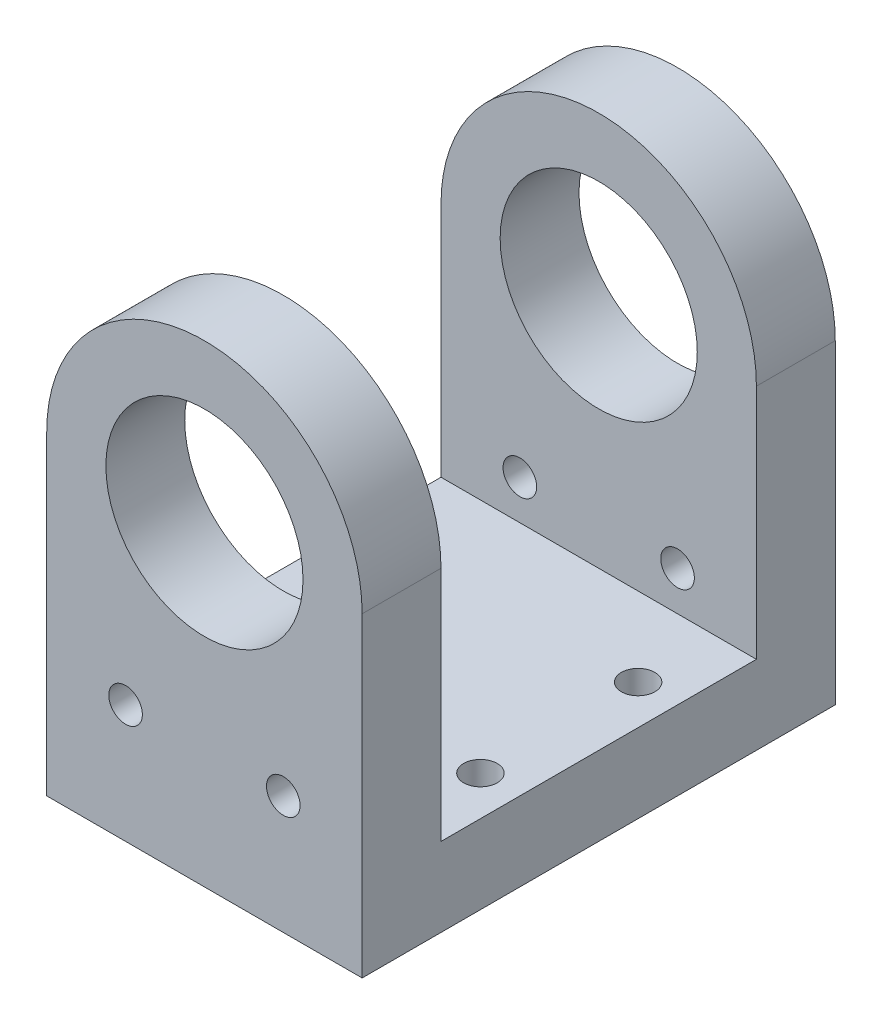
from build123d import *

# Parameters (mm, degrees)
SKETCH1_R             = 7.9375
EXTRUDE1_DEPTH        = 19.05
SKETCH2_W             = 25.4
SKETCH2_H             = 34.695876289
CUT_EXTRUDE1_DEPTH    = 50.595085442
F_6_32_TAPPED_HOLE1_D = 2.7051
F_6_32_TAPPED_HOLE2_D = 2.7051


with BuildPart() as part:
    # Sketch1 → Extrude1 (new, symmetric)
    with BuildSketch(Plane.XY):
        with BuildLine():
            Line((12.7, 0), (-12.7, 0))
            Line((-12.7, 0), (-12.7, 25.4))
            ThreePointArc((-12.7, 25.4), (0, 38.1), (12.7, 25.4))
            Line((12.7, 25.4), (12.7, 0))
        make_face()
        with Locations(Location((0, 25.4, 0), (0, 0, 180))):
            Circle(SKETCH1_R, mode=Mode.SUBTRACT)
    extrude(amount=EXTRUDE1_DEPTH, both=True)

    # Sketch2 → Cut-Extrude1 (cut, through all)
    with BuildSketch(Plane(origin=(12.7, 0, 0), x_dir=(0, 0, -1), z_dir=(1, 0, 0))):
        with Locations((0, 23.697938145)):
            Rectangle(SKETCH2_W, SKETCH2_H)
    extrude(amount=-CUT_EXTRUDE1_DEPTH, mode=Mode.SUBTRACT)

    # 6-32 Tapped Hole1 (through all)
    with Locations(Plane.XZ):
        with Locations((-9.525, -6.35), (-9.525, 6.35), (9.525, -6.35), (9.525, 6.35)):
            Hole(F_6_32_TAPPED_HOLE1_D / 2)

    # 6-32 Tapped Hole2 (through all)
    with Locations(Plane(origin=(0, 0, -19.05), x_dir=(-1, 0, 0), z_dir=(0, 0, -1))):
        with Locations((6.35, 9.525), (-6.35, 9.525)):
            Hole(F_6_32_TAPPED_HOLE2_D / 2)


solid = part.part
